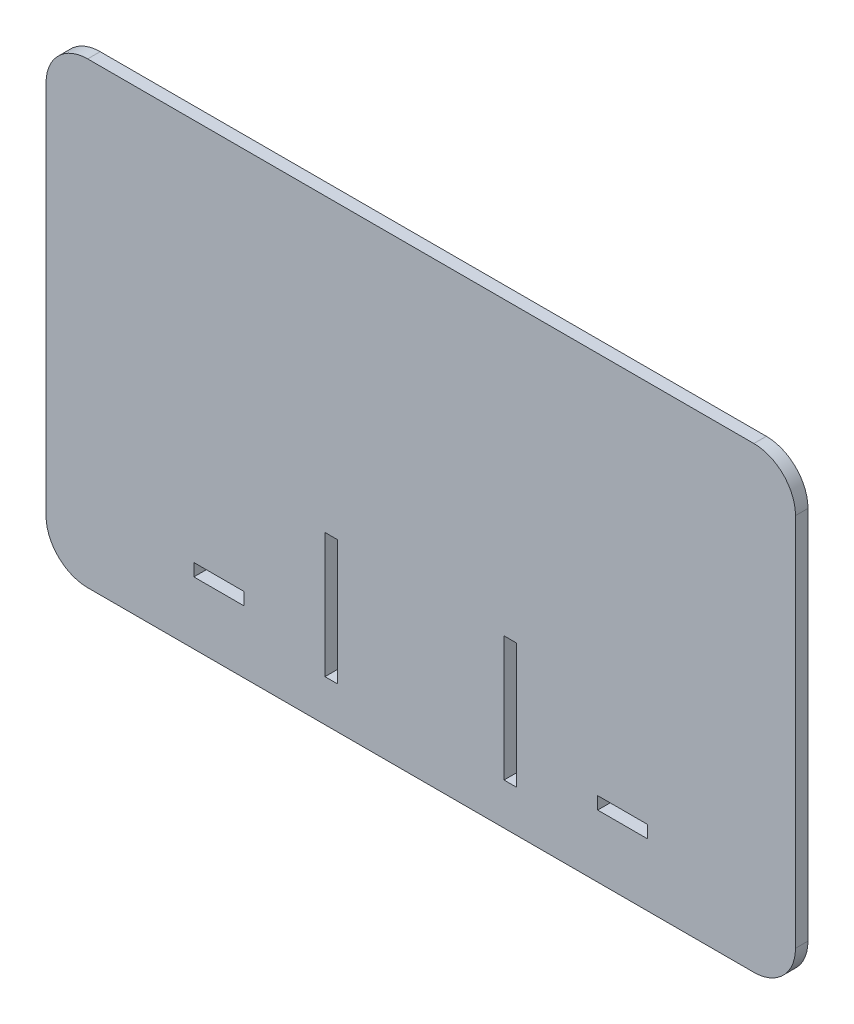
ISO-10303-21;
HEADER;
FILE_DESCRIPTION(('STEP AP214'),'2;1');
FILE_NAME('part.step','',(''),(''),'','','');
FILE_SCHEMA(('AUTOMOTIVE_DESIGN { 1 0 10303 214 1 1 1 1 }'));
ENDSEC;
DATA;
#1=APPLICATION_CONTEXT('core data for automotive mechanical design processes');
#2=APPLICATION_PROTOCOL_DEFINITION('international standard','automotive_design',2000,#1);
#3=PRODUCT_CONTEXT('',#1,'mechanical');
#4=PRODUCT('Part','Part','',(#3));
#5=PRODUCT_RELATED_PRODUCT_CATEGORY('part','',(#4));
#6=PRODUCT_DEFINITION_FORMATION('','',#4);
#7=PRODUCT_DEFINITION_CONTEXT('part definition',#1,'design');
#8=PRODUCT_DEFINITION('design','',#6,#7);
#9=PRODUCT_DEFINITION_SHAPE('','',#8);
#10=(LENGTH_UNIT() NAMED_UNIT(*) SI_UNIT(.MILLI.,.METRE.));
#11=(NAMED_UNIT(*) PLANE_ANGLE_UNIT() SI_UNIT($,.RADIAN.));
#12=(NAMED_UNIT(*) SI_UNIT($,.STERADIAN.) SOLID_ANGLE_UNIT());
#13=UNCERTAINTY_MEASURE_WITH_UNIT(LENGTH_MEASURE(1.E-05),#10,'distance_accuracy_value','');
#14=(GEOMETRIC_REPRESENTATION_CONTEXT(3) GLOBAL_UNCERTAINTY_ASSIGNED_CONTEXT((#13)) GLOBAL_UNIT_ASSIGNED_CONTEXT((#10,
#11,#12)) REPRESENTATION_CONTEXT('',''));
#15=CARTESIAN_POINT('',(0.,0.,0.));
#16=DIRECTION('',(0.,0.,1.));
#17=DIRECTION('',(1.,0.,0.));
#18=AXIS2_PLACEMENT_3D('',#15,#16,#17);
#19=CARTESIAN_POINT('',(-58.4166254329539,-73.8599003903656,3.));
#20=DIRECTION('',(0.,0.,1.));
#21=DIRECTION('',(1.,0.,0.));
#22=AXIS2_PLACEMENT_3D('',#19,#20,#21);
#23=PLANE('',#22);
#24=CARTESIAN_POINT('',(-58.4166254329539,-73.8599003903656,3.));
#25=DIRECTION('',(0.,0.,1.));
#26=DIRECTION('',(1.,0.,0.));
#27=AXIS2_PLACEMENT_3D('',#24,#25,#26);
#28=CIRCLE('',#27,9.99999999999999);
#29=CARTESIAN_POINT('',(-68.4166254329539,-73.8599003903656,3.));
#30=VERTEX_POINT('',#29);
#31=CARTESIAN_POINT('',(-58.4166254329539,-83.8599003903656,3.));
#32=VERTEX_POINT('',#31);
#33=EDGE_CURVE('E323',#30,#32,#28,.T.);
#34=ORIENTED_EDGE('',*,*,#33,.T.);
#35=DIRECTION('',(1.,0.,0.));
#36=VECTOR('',#35,1.);
#37=CARTESIAN_POINT('',(-58.4166254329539,-83.8599003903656,3.));
#38=LINE('',#37,#36);
#39=CARTESIAN_POINT('',(101.583374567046,-83.8599003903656,3.));
#40=VERTEX_POINT('',#39);
#41=EDGE_CURVE('E326',#32,#40,#38,.T.);
#42=ORIENTED_EDGE('',*,*,#41,.T.);
#43=CARTESIAN_POINT('',(101.583374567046,-73.8599003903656,3.));
#44=DIRECTION('',(0.,0.,1.));
#45=DIRECTION('',(1.,0.,0.));
#46=AXIS2_PLACEMENT_3D('',#43,#44,#45);
#47=CIRCLE('',#46,10.);
#48=CARTESIAN_POINT('',(111.583374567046,-73.8599003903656,3.));
#49=VERTEX_POINT('',#48);
#50=EDGE_CURVE('E329',#40,#49,#47,.T.);
#51=ORIENTED_EDGE('',*,*,#50,.T.);
#52=DIRECTION('',(0.,1.,0.));
#53=VECTOR('',#52,1.);
#54=CARTESIAN_POINT('',(111.583374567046,16.1400996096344,3.));
#55=LINE('',#54,#53);
#56=CARTESIAN_POINT('',(111.583374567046,16.1400996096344,3.));
#57=VERTEX_POINT('',#56);
#58=EDGE_CURVE('E331',#49,#57,#55,.T.);
#59=ORIENTED_EDGE('',*,*,#58,.T.);
#60=CARTESIAN_POINT('',(101.583374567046,16.1400996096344,3.));
#61=DIRECTION('',(0.,0.,1.));
#62=DIRECTION('',(1.,0.,0.));
#63=AXIS2_PLACEMENT_3D('',#60,#61,#62);
#64=CIRCLE('',#63,9.99999999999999);
#65=CARTESIAN_POINT('',(101.583374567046,26.1400996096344,3.));
#66=VERTEX_POINT('',#65);
#67=EDGE_CURVE('E333',#57,#66,#64,.T.);
#68=ORIENTED_EDGE('',*,*,#67,.T.);
#69=DIRECTION('',(-1.,0.,0.));
#70=VECTOR('',#69,1.);
#71=CARTESIAN_POINT('',(-58.4166254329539,26.1400996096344,3.));
#72=LINE('',#71,#70);
#73=CARTESIAN_POINT('',(-58.4166254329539,26.1400996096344,3.));
#74=VERTEX_POINT('',#73);
#75=EDGE_CURVE('E335',#66,#74,#72,.T.);
#76=ORIENTED_EDGE('',*,*,#75,.T.);
#77=CARTESIAN_POINT('',(-58.4166254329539,16.1400996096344,3.));
#78=DIRECTION('',(0.,0.,1.));
#79=DIRECTION('',(-1.,0.,0.));
#80=AXIS2_PLACEMENT_3D('',#77,#78,#79);
#81=CIRCLE('',#80,10.);
#82=CARTESIAN_POINT('',(-68.4166254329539,16.1400996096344,3.));
#83=VERTEX_POINT('',#82);
#84=EDGE_CURVE('E337',#74,#83,#81,.T.);
#85=ORIENTED_EDGE('',*,*,#84,.T.);
#86=DIRECTION('',(0.,-1.,0.));
#87=VECTOR('',#86,1.);
#88=CARTESIAN_POINT('',(-68.4166254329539,16.1400996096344,3.));
#89=LINE('',#88,#87);
#90=EDGE_CURVE('E339',#83,#30,#89,.T.);
#91=ORIENTED_EDGE('',*,*,#90,.T.);
#92=EDGE_LOOP('',(#34,#42,#51,#59,#68,#76,#85,#91));
#93=FACE_BOUND('',#92,.T.);
#94=DIRECTION('',(-1.,0.,0.));
#95=VECTOR('',#94,1.);
#96=CARTESIAN_POINT('',(1.58337456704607,-43.8599003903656,3.));
#97=LINE('',#96,#95);
#98=CARTESIAN_POINT('',(1.58337456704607,-43.8599003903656,3.));
#99=VERTEX_POINT('',#98);
#100=CARTESIAN_POINT('',(-1.41662543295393,-43.8599003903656,3.));
#101=VERTEX_POINT('',#100);
#102=EDGE_CURVE('E294',#99,#101,#97,.T.);
#103=ORIENTED_EDGE('',*,*,#102,.F.);
#104=DIRECTION('',(0.,1.,0.));
#105=VECTOR('',#104,1.);
#106=CARTESIAN_POINT('',(1.58337456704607,-73.8599003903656,3.));
#107=LINE('',#106,#105);
#108=CARTESIAN_POINT('',(1.58337456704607,-73.8599003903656,3.));
#109=VERTEX_POINT('',#108);
#110=EDGE_CURVE('E292',#109,#99,#107,.T.);
#111=ORIENTED_EDGE('',*,*,#110,.F.);
#112=DIRECTION('',(1.,0.,0.));
#113=VECTOR('',#112,1.);
#114=CARTESIAN_POINT('',(1.58337456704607,-73.8599003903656,3.));
#115=LINE('',#114,#113);
#116=CARTESIAN_POINT('',(-1.41662543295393,-73.8599003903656,3.));
#117=VERTEX_POINT('',#116);
#118=EDGE_CURVE('E300',#117,#109,#115,.T.);
#119=ORIENTED_EDGE('',*,*,#118,.F.);
#120=DIRECTION('',(0.,-1.,0.));
#121=VECTOR('',#120,1.);
#122=CARTESIAN_POINT('',(-1.41662543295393,-73.8599003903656,3.));
#123=LINE('',#122,#121);
#124=EDGE_CURVE('E297',#101,#117,#123,.T.);
#125=ORIENTED_EDGE('',*,*,#124,.F.);
#126=EDGE_LOOP('',(#103,#111,#119,#125));
#127=FACE_BOUND('',#126,.T.);
#128=DIRECTION('',(1.,0.,0.));
#129=VECTOR('',#128,1.);
#130=CARTESIAN_POINT('',(41.5833745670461,-73.8599003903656,3.));
#131=LINE('',#130,#129);
#132=CARTESIAN_POINT('',(41.5833745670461,-73.8599003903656,3.));
#133=VERTEX_POINT('',#132);
#134=CARTESIAN_POINT('',(44.5833745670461,-73.8599003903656,3.));
#135=VERTEX_POINT('',#134);
#136=EDGE_CURVE('E263',#133,#135,#131,.T.);
#137=ORIENTED_EDGE('',*,*,#136,.F.);
#138=DIRECTION('',(0.,-1.,0.));
#139=VECTOR('',#138,1.);
#140=CARTESIAN_POINT('',(41.5833745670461,-73.8599003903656,3.));
#141=LINE('',#140,#139);
#142=CARTESIAN_POINT('',(41.5833745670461,-43.8599003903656,3.));
#143=VERTEX_POINT('',#142);
#144=EDGE_CURVE('E261',#143,#133,#141,.T.);
#145=ORIENTED_EDGE('',*,*,#144,.F.);
#146=DIRECTION('',(-1.,0.,0.));
#147=VECTOR('',#146,1.);
#148=CARTESIAN_POINT('',(41.5833745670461,-43.8599003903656,3.));
#149=LINE('',#148,#147);
#150=CARTESIAN_POINT('',(44.5833745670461,-43.8599003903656,3.));
#151=VERTEX_POINT('',#150);
#152=EDGE_CURVE('E269',#151,#143,#149,.T.);
#153=ORIENTED_EDGE('',*,*,#152,.F.);
#154=DIRECTION('',(0.,1.,0.));
#155=VECTOR('',#154,1.);
#156=CARTESIAN_POINT('',(44.5833745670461,-73.8599003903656,3.));
#157=LINE('',#156,#155);
#158=EDGE_CURVE('E266',#135,#151,#157,.T.);
#159=ORIENTED_EDGE('',*,*,#158,.F.);
#160=EDGE_LOOP('',(#137,#145,#153,#159));
#161=FACE_BOUND('',#160,.T.);
#162=DIRECTION('',(1.,0.,0.));
#163=VECTOR('',#162,1.);
#164=CARTESIAN_POINT('',(-32.9166254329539,-68.8599003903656,3.));
#165=LINE('',#164,#163);
#166=CARTESIAN_POINT('',(-32.9166254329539,-68.8599003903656,3.));
#167=VERTEX_POINT('',#166);
#168=CARTESIAN_POINT('',(-20.9166254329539,-68.8599003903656,3.));
#169=VERTEX_POINT('',#168);
#170=EDGE_CURVE('E232',#167,#169,#165,.T.);
#171=ORIENTED_EDGE('',*,*,#170,.F.);
#172=DIRECTION('',(0.,-1.,0.));
#173=VECTOR('',#172,1.);
#174=CARTESIAN_POINT('',(-32.9166254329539,-65.8599003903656,3.));
#175=LINE('',#174,#173);
#176=CARTESIAN_POINT('',(-32.9166254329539,-65.8599003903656,3.));
#177=VERTEX_POINT('',#176);
#178=EDGE_CURVE('E230',#177,#167,#175,.T.);
#179=ORIENTED_EDGE('',*,*,#178,.F.);
#180=DIRECTION('',(-1.,0.,0.));
#181=VECTOR('',#180,1.);
#182=CARTESIAN_POINT('',(-32.9166254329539,-65.8599003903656,3.));
#183=LINE('',#182,#181);
#184=CARTESIAN_POINT('',(-20.9166254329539,-65.8599003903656,3.));
#185=VERTEX_POINT('',#184);
#186=EDGE_CURVE('E238',#185,#177,#183,.T.);
#187=ORIENTED_EDGE('',*,*,#186,.F.);
#188=DIRECTION('',(0.,1.,0.));
#189=VECTOR('',#188,1.);
#190=CARTESIAN_POINT('',(-20.9166254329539,-65.8599003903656,3.));
#191=LINE('',#190,#189);
#192=EDGE_CURVE('E235',#169,#185,#191,.T.);
#193=ORIENTED_EDGE('',*,*,#192,.F.);
#194=EDGE_LOOP('',(#171,#179,#187,#193));
#195=FACE_BOUND('',#194,.T.);
#196=DIRECTION('',(0.,-1.,0.));
#197=VECTOR('',#196,1.);
#198=CARTESIAN_POINT('',(64.0833745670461,-65.8599003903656,3.));
#199=LINE('',#198,#197);
#200=CARTESIAN_POINT('',(64.0833745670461,-65.8599003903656,3.));
#201=VERTEX_POINT('',#200);
#202=CARTESIAN_POINT('',(64.0833745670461,-68.8599003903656,3.));
#203=VERTEX_POINT('',#202);
#204=EDGE_CURVE('E202',#201,#203,#199,.T.);
#205=ORIENTED_EDGE('',*,*,#204,.F.);
#206=DIRECTION('',(-1.,0.,0.));
#207=VECTOR('',#206,1.);
#208=CARTESIAN_POINT('',(76.0833745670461,-65.8599003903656,3.));
#209=LINE('',#208,#207);
#210=CARTESIAN_POINT('',(76.0833745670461,-65.8599003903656,3.));
#211=VERTEX_POINT('',#210);
#212=EDGE_CURVE('E194',#211,#201,#209,.T.);
#213=ORIENTED_EDGE('',*,*,#212,.F.);
#214=DIRECTION('',(0.,1.,0.));
#215=VECTOR('',#214,1.);
#216=CARTESIAN_POINT('',(76.0833745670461,-65.8599003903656,3.));
#217=LINE('',#216,#215);
#218=CARTESIAN_POINT('',(76.0833745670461,-68.8599003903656,3.));
#219=VERTEX_POINT('',#218);
#220=EDGE_CURVE('E216',#219,#211,#217,.T.);
#221=ORIENTED_EDGE('',*,*,#220,.F.);
#222=DIRECTION('',(1.,0.,0.));
#223=VECTOR('',#222,1.);
#224=CARTESIAN_POINT('',(76.0833745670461,-68.8599003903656,3.));
#225=LINE('',#224,#223);
#226=EDGE_CURVE('E214',#203,#219,#225,.T.);
#227=ORIENTED_EDGE('',*,*,#226,.F.);
#228=EDGE_LOOP('',(#205,#213,#221,#227));
#229=FACE_BOUND('',#228,.T.);
#230=ADVANCED_FACE('F33',(#93,#127,#161,#195,#229),#23,.T.);
#231=CARTESIAN_POINT('',(-58.4166254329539,-73.8599003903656,0.));
#232=DIRECTION('',(0.,0.,1.));
#233=DIRECTION('',(1.,0.,0.));
#234=AXIS2_PLACEMENT_3D('',#231,#232,#233);
#235=PLANE('',#234);
#236=DIRECTION('',(0.,-1.,0.));
#237=VECTOR('',#236,1.);
#238=CARTESIAN_POINT('',(-32.9166254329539,-65.8599003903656,0.));
#239=LINE('',#238,#237);
#240=CARTESIAN_POINT('',(-32.9166254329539,-65.8599003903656,0.));
#241=VERTEX_POINT('',#240);
#242=CARTESIAN_POINT('',(-32.9166254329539,-68.8599003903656,0.));
#243=VERTEX_POINT('',#242);
#244=EDGE_CURVE('E210',#241,#243,#239,.T.);
#245=ORIENTED_EDGE('',*,*,#244,.T.);
#246=DIRECTION('',(1.,0.,0.));
#247=VECTOR('',#246,1.);
#248=CARTESIAN_POINT('',(-32.9166254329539,-68.8599003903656,0.));
#249=LINE('',#248,#247);
#250=CARTESIAN_POINT('',(-20.9166254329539,-68.8599003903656,0.));
#251=VERTEX_POINT('',#250);
#252=EDGE_CURVE('E243',#243,#251,#249,.T.);
#253=ORIENTED_EDGE('',*,*,#252,.T.);
#254=DIRECTION('',(0.,1.,0.));
#255=VECTOR('',#254,1.);
#256=CARTESIAN_POINT('',(-20.9166254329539,-65.8599003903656,0.));
#257=LINE('',#256,#255);
#258=CARTESIAN_POINT('',(-20.9166254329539,-65.8599003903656,0.));
#259=VERTEX_POINT('',#258);
#260=EDGE_CURVE('E246',#251,#259,#257,.T.);
#261=ORIENTED_EDGE('',*,*,#260,.T.);
#262=DIRECTION('',(-1.,0.,0.));
#263=VECTOR('',#262,1.);
#264=CARTESIAN_POINT('',(-32.9166254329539,-65.8599003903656,0.));
#265=LINE('',#264,#263);
#266=EDGE_CURVE('E233',#259,#241,#265,.T.);
#267=ORIENTED_EDGE('',*,*,#266,.T.);
#268=EDGE_LOOP('',(#245,#253,#261,#267));
#269=FACE_BOUND('',#268,.T.);
#270=DIRECTION('',(0.,1.,0.));
#271=VECTOR('',#270,1.);
#272=CARTESIAN_POINT('',(1.58337456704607,-73.8599003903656,0.));
#273=LINE('',#272,#271);
#274=CARTESIAN_POINT('',(1.58337456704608,-73.8599003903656,0.));
#275=VERTEX_POINT('',#274);
#276=CARTESIAN_POINT('',(1.58337456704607,-43.8599003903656,0.));
#277=VERTEX_POINT('',#276);
#278=EDGE_CURVE('E291',#275,#277,#273,.T.);
#279=ORIENTED_EDGE('',*,*,#278,.T.);
#280=DIRECTION('',(-1.,0.,0.));
#281=VECTOR('',#280,1.);
#282=CARTESIAN_POINT('',(1.58337456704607,-43.8599003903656,0.));
#283=LINE('',#282,#281);
#284=CARTESIAN_POINT('',(-1.41662543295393,-43.8599003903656,0.));
#285=VERTEX_POINT('',#284);
#286=EDGE_CURVE('E305',#277,#285,#283,.T.);
#287=ORIENTED_EDGE('',*,*,#286,.T.);
#288=DIRECTION('',(0.,-1.,0.));
#289=VECTOR('',#288,1.);
#290=CARTESIAN_POINT('',(-1.41662543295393,-73.8599003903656,0.));
#291=LINE('',#290,#289);
#292=CARTESIAN_POINT('',(-1.41662543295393,-73.8599003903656,0.));
#293=VERTEX_POINT('',#292);
#294=EDGE_CURVE('E308',#285,#293,#291,.T.);
#295=ORIENTED_EDGE('',*,*,#294,.T.);
#296=DIRECTION('',(1.,0.,0.));
#297=VECTOR('',#296,1.);
#298=CARTESIAN_POINT('',(1.58337456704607,-73.8599003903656,0.));
#299=LINE('',#298,#297);
#300=EDGE_CURVE('E295',#293,#275,#299,.T.);
#301=ORIENTED_EDGE('',*,*,#300,.T.);
#302=EDGE_LOOP('',(#279,#287,#295,#301));
#303=FACE_BOUND('',#302,.T.);
#304=CARTESIAN_POINT('',(-58.4166254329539,-73.8599003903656,0.));
#305=DIRECTION('',(0.,0.,1.));
#306=DIRECTION('',(1.,0.,0.));
#307=AXIS2_PLACEMENT_3D('',#304,#305,#306);
#308=CIRCLE('',#307,9.99999999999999);
#309=CARTESIAN_POINT('',(-68.4166254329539,-73.8599003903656,0.));
#310=VERTEX_POINT('',#309);
#311=CARTESIAN_POINT('',(-58.4166254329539,-83.8599003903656,0.));
#312=VERTEX_POINT('',#311);
#313=EDGE_CURVE('E322',#310,#312,#308,.T.);
#314=ORIENTED_EDGE('',*,*,#313,.F.);
#315=DIRECTION('',(0.,-1.,0.));
#316=VECTOR('',#315,1.);
#317=CARTESIAN_POINT('',(-68.4166254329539,16.1400996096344,0.));
#318=LINE('',#317,#316);
#319=CARTESIAN_POINT('',(-68.4166254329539,16.1400996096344,0.));
#320=VERTEX_POINT('',#319);
#321=EDGE_CURVE('E327',#320,#310,#318,.T.);
#322=ORIENTED_EDGE('',*,*,#321,.F.);
#323=CARTESIAN_POINT('',(-58.4166254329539,16.1400996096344,0.));
#324=DIRECTION('',(0.,0.,1.));
#325=DIRECTION('',(-1.,0.,0.));
#326=AXIS2_PLACEMENT_3D('',#323,#324,#325);
#327=CIRCLE('',#326,10.);
#328=CARTESIAN_POINT('',(-58.4166254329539,26.1400996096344,0.));
#329=VERTEX_POINT('',#328);
#330=EDGE_CURVE('E354',#329,#320,#327,.T.);
#331=ORIENTED_EDGE('',*,*,#330,.F.);
#332=DIRECTION('',(-1.,0.,0.));
#333=VECTOR('',#332,1.);
#334=CARTESIAN_POINT('',(-58.4166254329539,26.1400996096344,0.));
#335=LINE('',#334,#333);
#336=CARTESIAN_POINT('',(101.583374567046,26.1400996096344,0.));
#337=VERTEX_POINT('',#336);
#338=EDGE_CURVE('E352',#337,#329,#335,.T.);
#339=ORIENTED_EDGE('',*,*,#338,.F.);
#340=CARTESIAN_POINT('',(101.583374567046,16.1400996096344,0.));
#341=DIRECTION('',(0.,0.,1.));
#342=DIRECTION('',(1.,0.,0.));
#343=AXIS2_PLACEMENT_3D('',#340,#341,#342);
#344=CIRCLE('',#343,9.99999999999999);
#345=CARTESIAN_POINT('',(111.583374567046,16.1400996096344,0.));
#346=VERTEX_POINT('',#345);
#347=EDGE_CURVE('E350',#346,#337,#344,.T.);
#348=ORIENTED_EDGE('',*,*,#347,.F.);
#349=DIRECTION('',(0.,1.,0.));
#350=VECTOR('',#349,1.);
#351=CARTESIAN_POINT('',(111.583374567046,16.1400996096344,0.));
#352=LINE('',#351,#350);
#353=CARTESIAN_POINT('',(111.583374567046,-73.8599003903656,0.));
#354=VERTEX_POINT('',#353);
#355=EDGE_CURVE('E348',#354,#346,#352,.T.);
#356=ORIENTED_EDGE('',*,*,#355,.F.);
#357=CARTESIAN_POINT('',(101.583374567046,-73.8599003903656,0.));
#358=DIRECTION('',(0.,0.,1.));
#359=DIRECTION('',(1.,0.,0.));
#360=AXIS2_PLACEMENT_3D('',#357,#358,#359);
#361=CIRCLE('',#360,10.);
#362=CARTESIAN_POINT('',(101.583374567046,-83.8599003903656,0.));
#363=VERTEX_POINT('',#362);
#364=EDGE_CURVE('E346',#363,#354,#361,.T.);
#365=ORIENTED_EDGE('',*,*,#364,.F.);
#366=DIRECTION('',(1.,0.,0.));
#367=VECTOR('',#366,1.);
#368=CARTESIAN_POINT('',(-58.4166254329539,-83.8599003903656,0.));
#369=LINE('',#368,#367);
#370=EDGE_CURVE('E344',#312,#363,#369,.T.);
#371=ORIENTED_EDGE('',*,*,#370,.F.);
#372=EDGE_LOOP('',(#314,#322,#331,#339,#348,#356,#365,#371));
#373=FACE_BOUND('',#372,.T.);
#374=DIRECTION('',(0.,-1.,0.));
#375=VECTOR('',#374,1.);
#376=CARTESIAN_POINT('',(41.5833745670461,-73.8599003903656,0.));
#377=LINE('',#376,#375);
#378=CARTESIAN_POINT('',(41.5833745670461,-43.8599003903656,0.));
#379=VERTEX_POINT('',#378);
#380=CARTESIAN_POINT('',(41.5833745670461,-73.8599003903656,0.));
#381=VERTEX_POINT('',#380);
#382=EDGE_CURVE('E260',#379,#381,#377,.T.);
#383=ORIENTED_EDGE('',*,*,#382,.T.);
#384=DIRECTION('',(1.,0.,0.));
#385=VECTOR('',#384,1.);
#386=CARTESIAN_POINT('',(41.5833745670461,-73.8599003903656,0.));
#387=LINE('',#386,#385);
#388=CARTESIAN_POINT('',(44.5833745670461,-73.8599003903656,0.));
#389=VERTEX_POINT('',#388);
#390=EDGE_CURVE('E274',#381,#389,#387,.T.);
#391=ORIENTED_EDGE('',*,*,#390,.T.);
#392=DIRECTION('',(0.,1.,0.));
#393=VECTOR('',#392,1.);
#394=CARTESIAN_POINT('',(44.5833745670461,-73.8599003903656,0.));
#395=LINE('',#394,#393);
#396=CARTESIAN_POINT('',(44.5833745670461,-43.8599003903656,0.));
#397=VERTEX_POINT('',#396);
#398=EDGE_CURVE('E277',#389,#397,#395,.T.);
#399=ORIENTED_EDGE('',*,*,#398,.T.);
#400=DIRECTION('',(-1.,0.,0.));
#401=VECTOR('',#400,1.);
#402=CARTESIAN_POINT('',(41.5833745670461,-43.8599003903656,0.));
#403=LINE('',#402,#401);
#404=EDGE_CURVE('E264',#397,#379,#403,.T.);
#405=ORIENTED_EDGE('',*,*,#404,.T.);
#406=EDGE_LOOP('',(#383,#391,#399,#405));
#407=FACE_BOUND('',#406,.T.);
#408=DIRECTION('',(-1.,0.,0.));
#409=VECTOR('',#408,1.);
#410=CARTESIAN_POINT('',(76.0833745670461,-65.8599003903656,0.));
#411=LINE('',#410,#409);
#412=CARTESIAN_POINT('',(76.0833745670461,-65.8599003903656,0.));
#413=VERTEX_POINT('',#412);
#414=CARTESIAN_POINT('',(64.0833745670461,-65.8599003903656,0.));
#415=VERTEX_POINT('',#414);
#416=EDGE_CURVE('E56',#413,#415,#411,.T.);
#417=ORIENTED_EDGE('',*,*,#416,.T.);
#418=DIRECTION('',(0.,-1.,0.));
#419=VECTOR('',#418,1.);
#420=CARTESIAN_POINT('',(64.0833745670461,-65.8599003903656,0.));
#421=LINE('',#420,#419);
#422=CARTESIAN_POINT('',(64.0833745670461,-68.8599003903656,0.));
#423=VERTEX_POINT('',#422);
#424=EDGE_CURVE('E209',#415,#423,#421,.T.);
#425=ORIENTED_EDGE('',*,*,#424,.T.);
#426=DIRECTION('',(1.,0.,0.));
#427=VECTOR('',#426,1.);
#428=CARTESIAN_POINT('',(76.0833745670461,-68.8599003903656,0.));
#429=LINE('',#428,#427);
#430=CARTESIAN_POINT('',(76.0833745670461,-68.8599003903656,0.));
#431=VERTEX_POINT('',#430);
#432=EDGE_CURVE('E222',#423,#431,#429,.T.);
#433=ORIENTED_EDGE('',*,*,#432,.T.);
#434=DIRECTION('',(0.,1.,0.));
#435=VECTOR('',#434,1.);
#436=CARTESIAN_POINT('',(76.0833745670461,-65.8599003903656,0.));
#437=LINE('',#436,#435);
#438=EDGE_CURVE('E203',#431,#413,#437,.T.);
#439=ORIENTED_EDGE('',*,*,#438,.T.);
#440=EDGE_LOOP('',(#417,#425,#433,#439));
#441=FACE_BOUND('',#440,.T.);
#442=ADVANCED_FACE('F384',(#269,#303,#373,#407,#441),#235,.F.);
#443=CARTESIAN_POINT('',(-58.4166254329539,-73.8599003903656,3.));
#444=DIRECTION('',(0.,0.,-1.));
#445=DIRECTION('',(-1.,0.,0.));
#446=AXIS2_PLACEMENT_3D('',#443,#444,#445);
#447=CYLINDRICAL_SURFACE('',#446,9.99999999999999);
#448=ORIENTED_EDGE('',*,*,#313,.T.);
#449=DIRECTION('',(0.,0.,-1.));
#450=VECTOR('',#449,1.);
#451=CARTESIAN_POINT('',(-58.4166254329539,-83.8599003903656,3.));
#452=LINE('',#451,#450);
#453=EDGE_CURVE('E11',#32,#312,#452,.T.);
#454=ORIENTED_EDGE('',*,*,#453,.F.);
#455=ORIENTED_EDGE('',*,*,#33,.F.);
#456=DIRECTION('',(0.,0.,-1.));
#457=VECTOR('',#456,1.);
#458=CARTESIAN_POINT('',(-68.4166254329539,-73.8599003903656,3.));
#459=LINE('',#458,#457);
#460=EDGE_CURVE('E341',#30,#310,#459,.T.);
#461=ORIENTED_EDGE('',*,*,#460,.T.);
#462=EDGE_LOOP('',(#448,#454,#455,#461));
#463=FACE_BOUND('',#462,.T.);
#464=ADVANCED_FACE('F35',(#463),#447,.T.);
#465=CARTESIAN_POINT('',(-58.4166254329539,-83.8599003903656,3.));
#466=DIRECTION('',(0.,1.,0.));
#467=DIRECTION('',(0.,0.,1.));
#468=AXIS2_PLACEMENT_3D('',#465,#466,#467);
#469=PLANE('',#468);
#470=ORIENTED_EDGE('',*,*,#370,.T.);
#471=DIRECTION('',(0.,0.,-1.));
#472=VECTOR('',#471,1.);
#473=CARTESIAN_POINT('',(101.583374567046,-83.8599003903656,3.));
#474=LINE('',#473,#472);
#475=EDGE_CURVE('E41',#40,#363,#474,.T.);
#476=ORIENTED_EDGE('',*,*,#475,.F.);
#477=ORIENTED_EDGE('',*,*,#41,.F.);
#478=ORIENTED_EDGE('',*,*,#453,.T.);
#479=EDGE_LOOP('',(#470,#476,#477,#478));
#480=FACE_BOUND('',#479,.T.);
#481=ADVANCED_FACE('F402',(#480),#469,.F.);
#482=CARTESIAN_POINT('',(101.583374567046,-73.8599003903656,3.));
#483=DIRECTION('',(0.,0.,-1.));
#484=DIRECTION('',(-1.,0.,0.));
#485=AXIS2_PLACEMENT_3D('',#482,#483,#484);
#486=CYLINDRICAL_SURFACE('',#485,10.);
#487=ORIENTED_EDGE('',*,*,#364,.T.);
#488=DIRECTION('',(0.,0.,-1.));
#489=VECTOR('',#488,1.);
#490=CARTESIAN_POINT('',(111.583374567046,-73.8599003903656,3.));
#491=LINE('',#490,#489);
#492=EDGE_CURVE('E371',#49,#354,#491,.T.);
#493=ORIENTED_EDGE('',*,*,#492,.F.);
#494=ORIENTED_EDGE('',*,*,#50,.F.);
#495=ORIENTED_EDGE('',*,*,#475,.T.);
#496=EDGE_LOOP('',(#487,#493,#494,#495));
#497=FACE_BOUND('',#496,.T.);
#498=ADVANCED_FACE('F378',(#497),#486,.T.);
#499=CARTESIAN_POINT('',(111.583374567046,16.1400996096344,3.));
#500=DIRECTION('',(-1.,0.,0.));
#501=DIRECTION('',(0.,-1.,0.));
#502=AXIS2_PLACEMENT_3D('',#499,#500,#501);
#503=PLANE('',#502);
#504=ORIENTED_EDGE('',*,*,#355,.T.);
#505=DIRECTION('',(0.,0.,-1.));
#506=VECTOR('',#505,1.);
#507=CARTESIAN_POINT('',(111.583374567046,16.1400996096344,3.));
#508=LINE('',#507,#506);
#509=EDGE_CURVE('E368',#57,#346,#508,.T.);
#510=ORIENTED_EDGE('',*,*,#509,.F.);
#511=ORIENTED_EDGE('',*,*,#58,.F.);
#512=ORIENTED_EDGE('',*,*,#492,.T.);
#513=EDGE_LOOP('',(#504,#510,#511,#512));
#514=FACE_BOUND('',#513,.T.);
#515=ADVANCED_FACE('F390',(#514),#503,.F.);
#516=CARTESIAN_POINT('',(101.583374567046,16.1400996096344,3.));
#517=DIRECTION('',(0.,0.,-1.));
#518=DIRECTION('',(-1.,0.,0.));
#519=AXIS2_PLACEMENT_3D('',#516,#517,#518);
#520=CYLINDRICAL_SURFACE('',#519,9.99999999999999);
#521=ORIENTED_EDGE('',*,*,#347,.T.);
#522=DIRECTION('',(0.,0.,-1.));
#523=VECTOR('',#522,1.);
#524=CARTESIAN_POINT('',(101.583374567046,26.1400996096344,3.));
#525=LINE('',#524,#523);
#526=EDGE_CURVE('E365',#66,#337,#525,.T.);
#527=ORIENTED_EDGE('',*,*,#526,.F.);
#528=ORIENTED_EDGE('',*,*,#67,.F.);
#529=ORIENTED_EDGE('',*,*,#509,.T.);
#530=EDGE_LOOP('',(#521,#527,#528,#529));
#531=FACE_BOUND('',#530,.T.);
#532=ADVANCED_FACE('F394',(#531),#520,.T.);
#533=CARTESIAN_POINT('',(-58.4166254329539,26.1400996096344,3.));
#534=DIRECTION('',(0.,-1.,0.));
#535=DIRECTION('',(0.,0.,-1.));
#536=AXIS2_PLACEMENT_3D('',#533,#534,#535);
#537=PLANE('',#536);
#538=ORIENTED_EDGE('',*,*,#338,.T.);
#539=DIRECTION('',(0.,0.,-1.));
#540=VECTOR('',#539,1.);
#541=CARTESIAN_POINT('',(-58.4166254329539,26.1400996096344,3.));
#542=LINE('',#541,#540);
#543=EDGE_CURVE('E362',#74,#329,#542,.T.);
#544=ORIENTED_EDGE('',*,*,#543,.F.);
#545=ORIENTED_EDGE('',*,*,#75,.F.);
#546=ORIENTED_EDGE('',*,*,#526,.T.);
#547=EDGE_LOOP('',(#538,#544,#545,#546));
#548=FACE_BOUND('',#547,.T.);
#549=ADVANCED_FACE('F415',(#548),#537,.F.);
#550=CARTESIAN_POINT('',(-58.4166254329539,16.1400996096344,3.));
#551=DIRECTION('',(0.,0.,-1.));
#552=DIRECTION('',(-1.,0.,0.));
#553=AXIS2_PLACEMENT_3D('',#550,#551,#552);
#554=CYLINDRICAL_SURFACE('',#553,10.);
#555=ORIENTED_EDGE('',*,*,#330,.T.);
#556=DIRECTION('',(0.,0.,-1.));
#557=VECTOR('',#556,1.);
#558=CARTESIAN_POINT('',(-68.4166254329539,16.1400996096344,3.));
#559=LINE('',#558,#557);
#560=EDGE_CURVE('E359',#83,#320,#559,.T.);
#561=ORIENTED_EDGE('',*,*,#560,.F.);
#562=ORIENTED_EDGE('',*,*,#84,.F.);
#563=ORIENTED_EDGE('',*,*,#543,.T.);
#564=EDGE_LOOP('',(#555,#561,#562,#563));
#565=FACE_BOUND('',#564,.T.);
#566=ADVANCED_FACE('F413',(#565),#554,.T.);
#567=CARTESIAN_POINT('',(-68.4166254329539,16.1400996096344,3.));
#568=DIRECTION('',(1.,0.,0.));
#569=DIRECTION('',(0.,1.,0.));
#570=AXIS2_PLACEMENT_3D('',#567,#568,#569);
#571=PLANE('',#570);
#572=ORIENTED_EDGE('',*,*,#321,.T.);
#573=ORIENTED_EDGE('',*,*,#460,.F.);
#574=ORIENTED_EDGE('',*,*,#90,.F.);
#575=ORIENTED_EDGE('',*,*,#560,.T.);
#576=EDGE_LOOP('',(#572,#573,#574,#575));
#577=FACE_BOUND('',#576,.T.);
#578=ADVANCED_FACE('F408',(#577),#571,.F.);
#579=CARTESIAN_POINT('',(1.58337456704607,-73.8599003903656,3.));
#580=DIRECTION('',(-1.,0.,0.));
#581=DIRECTION('',(0.,0.,1.));
#582=AXIS2_PLACEMENT_3D('',#579,#580,#581);
#583=PLANE('',#582);
#584=ORIENTED_EDGE('',*,*,#278,.F.);
#585=DIRECTION('',(0.,0.,-1.));
#586=VECTOR('',#585,1.);
#587=CARTESIAN_POINT('',(1.58337456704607,-73.8599003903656,3.));
#588=LINE('',#587,#586);
#589=EDGE_CURVE('E302',#109,#275,#588,.T.);
#590=ORIENTED_EDGE('',*,*,#589,.F.);
#591=ORIENTED_EDGE('',*,*,#110,.T.);
#592=DIRECTION('',(0.,0.,-1.));
#593=VECTOR('',#592,1.);
#594=CARTESIAN_POINT('',(1.58337456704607,-43.8599003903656,3.));
#595=LINE('',#594,#593);
#596=EDGE_CURVE('E319',#99,#277,#595,.T.);
#597=ORIENTED_EDGE('',*,*,#596,.T.);
#598=EDGE_LOOP('',(#584,#590,#591,#597));
#599=FACE_BOUND('',#598,.T.);
#600=ADVANCED_FACE('F432',(#599),#583,.T.);
#601=CARTESIAN_POINT('',(1.58337456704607,-43.8599003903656,3.));
#602=DIRECTION('',(0.,-1.,0.));
#603=DIRECTION('',(0.,0.,-1.));
#604=AXIS2_PLACEMENT_3D('',#601,#602,#603);
#605=PLANE('',#604);
#606=ORIENTED_EDGE('',*,*,#286,.F.);
#607=ORIENTED_EDGE('',*,*,#596,.F.);
#608=ORIENTED_EDGE('',*,*,#102,.T.);
#609=DIRECTION('',(0.,0.,-1.));
#610=VECTOR('',#609,1.);
#611=CARTESIAN_POINT('',(-1.41662543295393,-43.8599003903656,3.));
#612=LINE('',#611,#610);
#613=EDGE_CURVE('E317',#101,#285,#612,.T.);
#614=ORIENTED_EDGE('',*,*,#613,.T.);
#615=EDGE_LOOP('',(#606,#607,#608,#614));
#616=FACE_BOUND('',#615,.T.);
#617=ADVANCED_FACE('F439',(#616),#605,.T.);
#618=CARTESIAN_POINT('',(-1.41662543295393,-73.8599003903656,3.));
#619=DIRECTION('',(1.,0.,0.));
#620=DIRECTION('',(0.,0.,-1.));
#621=AXIS2_PLACEMENT_3D('',#618,#619,#620);
#622=PLANE('',#621);
#623=ORIENTED_EDGE('',*,*,#294,.F.);
#624=ORIENTED_EDGE('',*,*,#613,.F.);
#625=ORIENTED_EDGE('',*,*,#124,.T.);
#626=DIRECTION('',(0.,0.,-1.));
#627=VECTOR('',#626,1.);
#628=CARTESIAN_POINT('',(-1.41662543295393,-73.8599003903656,3.));
#629=LINE('',#628,#627);
#630=EDGE_CURVE('E315',#117,#293,#629,.T.);
#631=ORIENTED_EDGE('',*,*,#630,.T.);
#632=EDGE_LOOP('',(#623,#624,#625,#631));
#633=FACE_BOUND('',#632,.T.);
#634=ADVANCED_FACE('F444',(#633),#622,.T.);
#635=CARTESIAN_POINT('',(1.58337456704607,-73.8599003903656,3.));
#636=DIRECTION('',(0.,1.,0.));
#637=DIRECTION('',(-1.,0.,0.));
#638=AXIS2_PLACEMENT_3D('',#635,#636,#637);
#639=PLANE('',#638);
#640=ORIENTED_EDGE('',*,*,#300,.F.);
#641=ORIENTED_EDGE('',*,*,#630,.F.);
#642=ORIENTED_EDGE('',*,*,#118,.T.);
#643=ORIENTED_EDGE('',*,*,#589,.T.);
#644=EDGE_LOOP('',(#640,#641,#642,#643));
#645=FACE_BOUND('',#644,.T.);
#646=ADVANCED_FACE('F452',(#645),#639,.T.);
#647=CARTESIAN_POINT('',(41.5833745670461,-73.8599003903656,3.));
#648=DIRECTION('',(1.,0.,0.));
#649=DIRECTION('',(0.,0.,-1.));
#650=AXIS2_PLACEMENT_3D('',#647,#648,#649);
#651=PLANE('',#650);
#652=ORIENTED_EDGE('',*,*,#382,.F.);
#653=DIRECTION('',(0.,0.,-1.));
#654=VECTOR('',#653,1.);
#655=CARTESIAN_POINT('',(41.5833745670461,-43.8599003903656,3.));
#656=LINE('',#655,#654);
#657=EDGE_CURVE('E271',#143,#379,#656,.T.);
#658=ORIENTED_EDGE('',*,*,#657,.F.);
#659=ORIENTED_EDGE('',*,*,#144,.T.);
#660=DIRECTION('',(0.,0.,-1.));
#661=VECTOR('',#660,1.);
#662=CARTESIAN_POINT('',(41.5833745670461,-73.8599003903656,3.));
#663=LINE('',#662,#661);
#664=EDGE_CURVE('E288',#133,#381,#663,.T.);
#665=ORIENTED_EDGE('',*,*,#664,.T.);
#666=EDGE_LOOP('',(#652,#658,#659,#665));
#667=FACE_BOUND('',#666,.T.);
#668=ADVANCED_FACE('F506',(#667),#651,.T.);
#669=CARTESIAN_POINT('',(41.5833745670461,-73.8599003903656,3.));
#670=DIRECTION('',(0.,1.,0.));
#671=DIRECTION('',(-1.,0.,0.));
#672=AXIS2_PLACEMENT_3D('',#669,#670,#671);
#673=PLANE('',#672);
#674=ORIENTED_EDGE('',*,*,#390,.F.);
#675=ORIENTED_EDGE('',*,*,#664,.F.);
#676=ORIENTED_EDGE('',*,*,#136,.T.);
#677=DIRECTION('',(0.,0.,-1.));
#678=VECTOR('',#677,1.);
#679=CARTESIAN_POINT('',(44.5833745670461,-73.8599003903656,3.));
#680=LINE('',#679,#678);
#681=EDGE_CURVE('E286',#135,#389,#680,.T.);
#682=ORIENTED_EDGE('',*,*,#681,.T.);
#683=EDGE_LOOP('',(#674,#675,#676,#682));
#684=FACE_BOUND('',#683,.T.);
#685=ADVANCED_FACE('F502',(#684),#673,.T.);
#686=CARTESIAN_POINT('',(44.5833745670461,-73.8599003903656,3.));
#687=DIRECTION('',(-1.,0.,0.));
#688=DIRECTION('',(0.,0.,1.));
#689=AXIS2_PLACEMENT_3D('',#686,#687,#688);
#690=PLANE('',#689);
#691=ORIENTED_EDGE('',*,*,#398,.F.);
#692=ORIENTED_EDGE('',*,*,#681,.F.);
#693=ORIENTED_EDGE('',*,*,#158,.T.);
#694=DIRECTION('',(0.,0.,-1.));
#695=VECTOR('',#694,1.);
#696=CARTESIAN_POINT('',(44.5833745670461,-43.8599003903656,3.));
#697=LINE('',#696,#695);
#698=EDGE_CURVE('E284',#151,#397,#697,.T.);
#699=ORIENTED_EDGE('',*,*,#698,.T.);
#700=EDGE_LOOP('',(#691,#692,#693,#699));
#701=FACE_BOUND('',#700,.T.);
#702=ADVANCED_FACE('F498',(#701),#690,.T.);
#703=CARTESIAN_POINT('',(41.5833745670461,-43.8599003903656,3.));
#704=DIRECTION('',(0.,-1.,0.));
#705=DIRECTION('',(0.,0.,-1.));
#706=AXIS2_PLACEMENT_3D('',#703,#704,#705);
#707=PLANE('',#706);
#708=ORIENTED_EDGE('',*,*,#404,.F.);
#709=ORIENTED_EDGE('',*,*,#698,.F.);
#710=ORIENTED_EDGE('',*,*,#152,.T.);
#711=ORIENTED_EDGE('',*,*,#657,.T.);
#712=EDGE_LOOP('',(#708,#709,#710,#711));
#713=FACE_BOUND('',#712,.T.);
#714=ADVANCED_FACE('F495',(#713),#707,.T.);
#715=CARTESIAN_POINT('',(-32.9166254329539,-65.8599003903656,3.));
#716=DIRECTION('',(1.,0.,0.));
#717=DIRECTION('',(0.,0.,-1.));
#718=AXIS2_PLACEMENT_3D('',#715,#716,#717);
#719=PLANE('',#718);
#720=ORIENTED_EDGE('',*,*,#244,.F.);
#721=DIRECTION('',(0.,0.,-1.));
#722=VECTOR('',#721,1.);
#723=CARTESIAN_POINT('',(-32.9166254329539,-65.8599003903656,3.));
#724=LINE('',#723,#722);
#725=EDGE_CURVE('E240',#177,#241,#724,.T.);
#726=ORIENTED_EDGE('',*,*,#725,.F.);
#727=ORIENTED_EDGE('',*,*,#178,.T.);
#728=DIRECTION('',(0.,0.,-1.));
#729=VECTOR('',#728,1.);
#730=CARTESIAN_POINT('',(-32.9166254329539,-68.8599003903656,3.));
#731=LINE('',#730,#729);
#732=EDGE_CURVE('E257',#167,#243,#731,.T.);
#733=ORIENTED_EDGE('',*,*,#732,.T.);
#734=EDGE_LOOP('',(#720,#726,#727,#733));
#735=FACE_BOUND('',#734,.T.);
#736=ADVANCED_FACE('F477',(#735),#719,.T.);
#737=CARTESIAN_POINT('',(-32.9166254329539,-68.8599003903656,3.));
#738=DIRECTION('',(0.,1.,0.));
#739=DIRECTION('',(0.,0.,1.));
#740=AXIS2_PLACEMENT_3D('',#737,#738,#739);
#741=PLANE('',#740);
#742=ORIENTED_EDGE('',*,*,#252,.F.);
#743=ORIENTED_EDGE('',*,*,#732,.F.);
#744=ORIENTED_EDGE('',*,*,#170,.T.);
#745=DIRECTION('',(0.,0.,-1.));
#746=VECTOR('',#745,1.);
#747=CARTESIAN_POINT('',(-20.9166254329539,-68.8599003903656,3.));
#748=LINE('',#747,#746);
#749=EDGE_CURVE('E255',#169,#251,#748,.T.);
#750=ORIENTED_EDGE('',*,*,#749,.T.);
#751=EDGE_LOOP('',(#742,#743,#744,#750));
#752=FACE_BOUND('',#751,.T.);
#753=ADVANCED_FACE('F471',(#752),#741,.T.);
#754=CARTESIAN_POINT('',(-20.9166254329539,-65.8599003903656,3.));
#755=DIRECTION('',(-1.,0.,0.));
#756=DIRECTION('',(0.,-1.,0.));
#757=AXIS2_PLACEMENT_3D('',#754,#755,#756);
#758=PLANE('',#757);
#759=ORIENTED_EDGE('',*,*,#260,.F.);
#760=ORIENTED_EDGE('',*,*,#749,.F.);
#761=ORIENTED_EDGE('',*,*,#192,.T.);
#762=DIRECTION('',(0.,0.,-1.));
#763=VECTOR('',#762,1.);
#764=CARTESIAN_POINT('',(-20.9166254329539,-65.8599003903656,3.));
#765=LINE('',#764,#763);
#766=EDGE_CURVE('E253',#185,#259,#765,.T.);
#767=ORIENTED_EDGE('',*,*,#766,.T.);
#768=EDGE_LOOP('',(#759,#760,#761,#767));
#769=FACE_BOUND('',#768,.T.);
#770=ADVANCED_FACE('F474',(#769),#758,.T.);
#771=CARTESIAN_POINT('',(-32.9166254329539,-65.8599003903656,3.));
#772=DIRECTION('',(0.,-1.,0.));
#773=DIRECTION('',(1.,0.,0.));
#774=AXIS2_PLACEMENT_3D('',#771,#772,#773);
#775=PLANE('',#774);
#776=ORIENTED_EDGE('',*,*,#266,.F.);
#777=ORIENTED_EDGE('',*,*,#766,.F.);
#778=ORIENTED_EDGE('',*,*,#186,.T.);
#779=ORIENTED_EDGE('',*,*,#725,.T.);
#780=EDGE_LOOP('',(#776,#777,#778,#779));
#781=FACE_BOUND('',#780,.T.);
#782=ADVANCED_FACE('F480',(#781),#775,.T.);
#783=CARTESIAN_POINT('',(76.0833745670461,-65.8599003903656,3.));
#784=DIRECTION('',(0.,-1.,0.));
#785=DIRECTION('',(1.,0.,0.));
#786=AXIS2_PLACEMENT_3D('',#783,#784,#785);
#787=PLANE('',#786);
#788=ORIENTED_EDGE('',*,*,#416,.F.);
#789=DIRECTION('',(0.,0.,-1.));
#790=VECTOR('',#789,1.);
#791=CARTESIAN_POINT('',(76.0833745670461,-65.8599003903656,3.));
#792=LINE('',#791,#790);
#793=EDGE_CURVE('E198',#211,#413,#792,.T.);
#794=ORIENTED_EDGE('',*,*,#793,.F.);
#795=ORIENTED_EDGE('',*,*,#212,.T.);
#796=DIRECTION('',(0.,0.,-1.));
#797=VECTOR('',#796,1.);
#798=CARTESIAN_POINT('',(64.0833745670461,-65.8599003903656,3.));
#799=LINE('',#798,#797);
#800=EDGE_CURVE('E197',#201,#415,#799,.T.);
#801=ORIENTED_EDGE('',*,*,#800,.T.);
#802=EDGE_LOOP('',(#788,#794,#795,#801));
#803=FACE_BOUND('',#802,.T.);
#804=ADVANCED_FACE('F196',(#803),#787,.T.);
#805=CARTESIAN_POINT('',(64.0833745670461,-65.8599003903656,3.));
#806=DIRECTION('',(1.,0.,0.));
#807=DIRECTION('',(0.,1.,0.));
#808=AXIS2_PLACEMENT_3D('',#805,#806,#807);
#809=PLANE('',#808);
#810=ORIENTED_EDGE('',*,*,#424,.F.);
#811=ORIENTED_EDGE('',*,*,#800,.F.);
#812=ORIENTED_EDGE('',*,*,#204,.T.);
#813=DIRECTION('',(0.,0.,-1.));
#814=VECTOR('',#813,1.);
#815=CARTESIAN_POINT('',(64.0833745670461,-68.8599003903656,3.));
#816=LINE('',#815,#814);
#817=EDGE_CURVE('E211',#203,#423,#816,.T.);
#818=ORIENTED_EDGE('',*,*,#817,.T.);
#819=EDGE_LOOP('',(#810,#811,#812,#818));
#820=FACE_BOUND('',#819,.T.);
#821=ADVANCED_FACE('F206',(#820),#809,.T.);
#822=CARTESIAN_POINT('',(76.0833745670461,-68.8599003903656,3.));
#823=DIRECTION('',(0.,1.,0.));
#824=DIRECTION('',(0.,0.,1.));
#825=AXIS2_PLACEMENT_3D('',#822,#823,#824);
#826=PLANE('',#825);
#827=ORIENTED_EDGE('',*,*,#432,.F.);
#828=ORIENTED_EDGE('',*,*,#817,.F.);
#829=ORIENTED_EDGE('',*,*,#226,.T.);
#830=DIRECTION('',(0.,0.,-1.));
#831=VECTOR('',#830,1.);
#832=CARTESIAN_POINT('',(76.0833745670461,-68.8599003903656,3.));
#833=LINE('',#832,#831);
#834=EDGE_CURVE('E48',#219,#431,#833,.T.);
#835=ORIENTED_EDGE('',*,*,#834,.T.);
#836=EDGE_LOOP('',(#827,#828,#829,#835));
#837=FACE_BOUND('',#836,.T.);
#838=ADVANCED_FACE('F569',(#837),#826,.T.);
#839=CARTESIAN_POINT('',(76.0833745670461,-65.8599003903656,3.));
#840=DIRECTION('',(-1.,0.,0.));
#841=DIRECTION('',(0.,-1.,0.));
#842=AXIS2_PLACEMENT_3D('',#839,#840,#841);
#843=PLANE('',#842);
#844=ORIENTED_EDGE('',*,*,#438,.F.);
#845=ORIENTED_EDGE('',*,*,#834,.F.);
#846=ORIENTED_EDGE('',*,*,#220,.T.);
#847=ORIENTED_EDGE('',*,*,#793,.T.);
#848=EDGE_LOOP('',(#844,#845,#846,#847));
#849=FACE_BOUND('',#848,.T.);
#850=ADVANCED_FACE('F577',(#849),#843,.T.);
#851=CLOSED_SHELL('',(#230,#442,#464,#481,#498,#515,#532,#549,#566,#578,#600,#617,#634,#646,
#668,#685,#702,#714,#736,#753,#770,#782,#804,#821,#838,#850));
#852=MANIFOLD_SOLID_BREP('B2',#851);
#853=ADVANCED_BREP_SHAPE_REPRESENTATION('',(#18,#852),#14);
#854=SHAPE_DEFINITION_REPRESENTATION(#9,#853);
ENDSEC;
END-ISO-10303-21;
